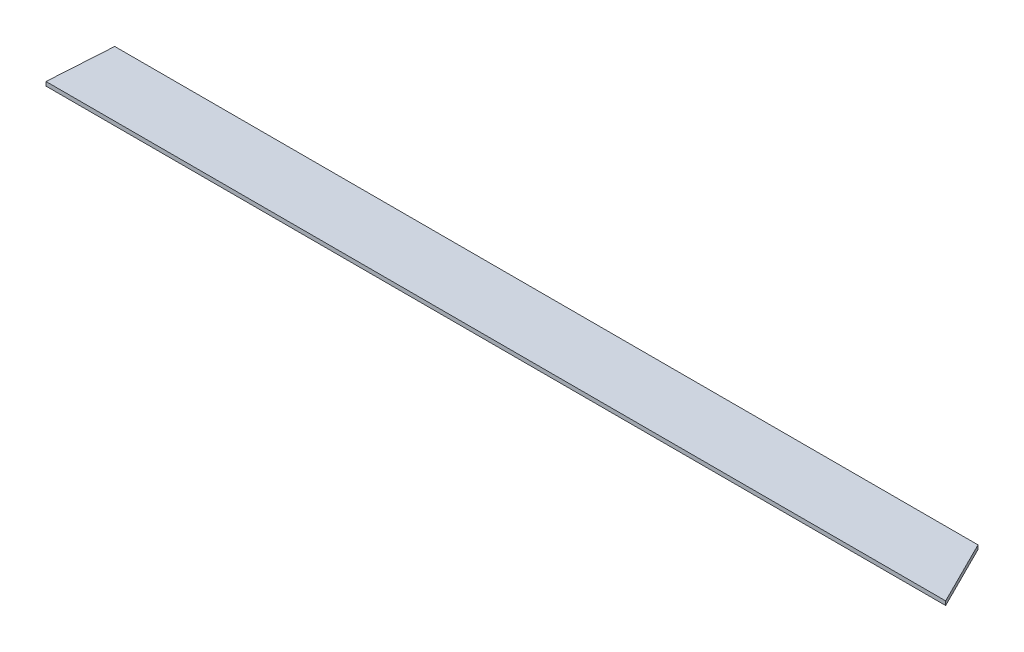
from build123d import *

# Parameters (mm, degrees)
BOSS_EXTRUDE1_DEPTH = 6.35


with BuildPart() as part:
    # Sketch1 → Boss-Extrude1 (new body)
    with BuildSketch(Plane(origin=(0, 0, 0), x_dir=(1, 0, 0), z_dir=(0, 1, 0))):
        Polygon((-688.745613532, 49.751376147), (666.979386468, 49.751376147), (717.779386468, -51.848623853), (-695.095613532, -51.848623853), align=None)
    extrude(amount=BOSS_EXTRUDE1_DEPTH)


solid = part.part
